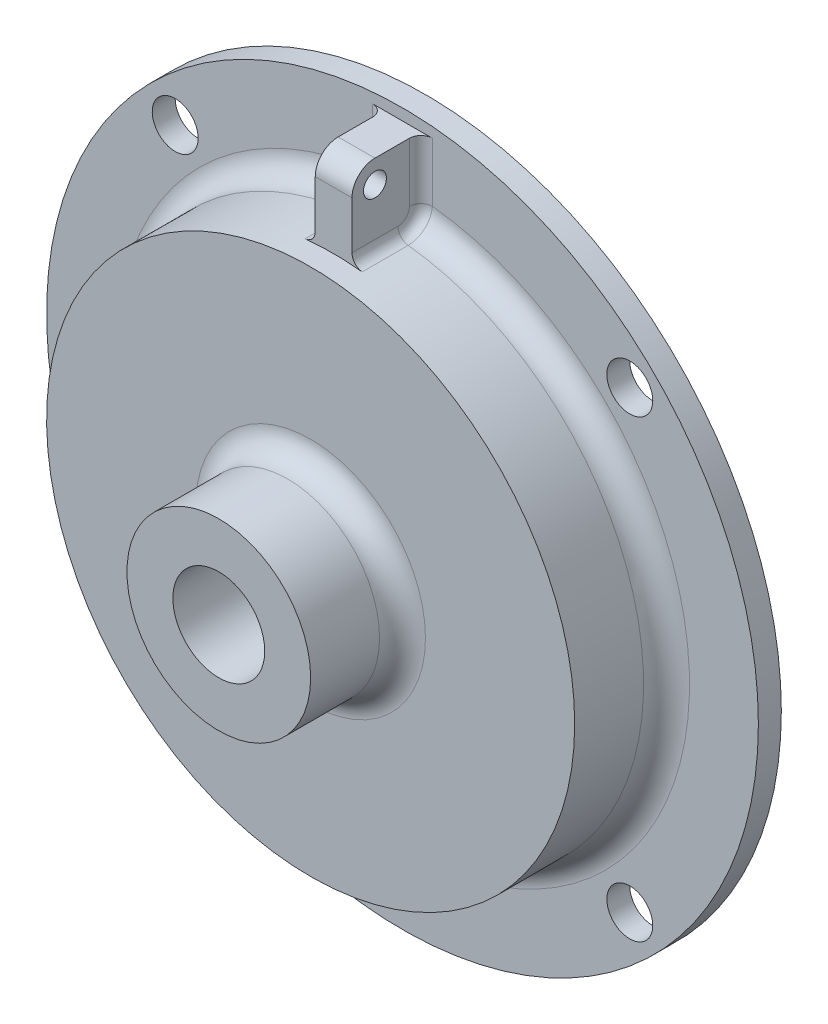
from build123d import *

# Parameters (mm, degrees)
SKETCH1_R           = 49.2125
BASE_EXTRUDE_DEPTH  = 3.175
SKETCH5_R           = 3.175
CUT_EXTRUDE2_DEPTH  = 70.669368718
CIRPATTERN1_COUNT   = 4
SKETCH2_R           = 36.5125
BOSS_EXTRUDE1_DEPTH = 12.7
SKETCH3_R           = 12.7
BOSS_EXTRUDE2_DEPTH = 12.7
FILLET1_R           = 3.175
SKETCH6_W           = 5.08
SKETCH6_H           = 9.525
BOSS_EXTRUDE3_DEPTH = 47.625
SKETCH4_R           = 6.35
CUT_EXTRUDE1_DEPTH  = 76.23477213
FILLET2_R           = 3.175
CUT_EXTRUDE3_REACH  = 78.92
SKETCH7_R           = 1.5875
FILLET3_R           = 1.5875


with BuildPart() as part:
    # Sketch1 → Base-Extrude (new body)
    with BuildSketch(Plane.XY):
        Circle(SKETCH1_R)
    extrude(amount=BASE_EXTRUDE_DEPTH)

    # Sketch5 → Cut-Extrude2 (cut, through all)
    with BuildSketch(Plane.XY.offset(3.175)):
        with Locations((31.430896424, 31.430896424)):
            Circle(SKETCH5_R)
    cut_extrude2 = extrude(amount=-CUT_EXTRUDE2_DEPTH, mode=Mode.SUBTRACT)

    # CirPattern1: Cut-Extrude2 ×4 about axis
    cirpattern1_axis = Axis((0, 0, 0), (0, 0, 1))
    for i in range(1, CIRPATTERN1_COUNT):
        add(cut_extrude2.rotate(cirpattern1_axis, i * 360 / CIRPATTERN1_COUNT), mode=Mode.SUBTRACT)

    # Sketch2 → Boss-Extrude1 (add)
    with BuildSketch(Plane.XY.offset(3.175)):
        Circle(SKETCH2_R)
    extrude(amount=BOSS_EXTRUDE1_DEPTH)

    # Sketch3 → Boss-Extrude2 (add)
    with BuildSketch(Plane.XY.offset(15.875)):
        Circle(SKETCH3_R)
    extrude(amount=BOSS_EXTRUDE2_DEPTH)

    # Fillet1
    fillet1_edges = [part.edges().sort_by_distance(p)[0] for p in [
        (-36.5125, 0, 3.175),
        (-12.7, 0, 15.875),
    ]]
    fillet(fillet1_edges, radius=FILLET1_R)

    # Sketch6 → Boss-Extrude3 (add)
    with BuildSketch(Plane(origin=(0, 0, 0), x_dir=(1, 0, 0), z_dir=(0, 1, 0))):
        with Locations((0, -7.9375)):
            Rectangle(SKETCH6_W, SKETCH6_H)
    extrude(amount=BOSS_EXTRUDE3_DEPTH)

    # Sketch4 → Cut-Extrude1 (cut, through all)
    with BuildSketch(Plane.XY.offset(28.575)):
        Circle(SKETCH4_R)
    extrude(amount=-CUT_EXTRUDE1_DEPTH, mode=Mode.SUBTRACT)

    # Fillet2
    fillet2_edges = [part.edges().sort_by_distance(p)[0] for p in [
        (0, 47.625, 12.7),
    ]]
    fillet(fillet2_edges, radius=FILLET2_R)

    # Sketch7 → Cut-Extrude3 (cut, up to next)
    with BuildSketch(Plane(origin=(2.54, 0, 0), x_dir=(0, 0, -1), z_dir=(1, 0, 0)), mode=Mode.PRIVATE) as cut_extrude3_sk1:
        with Locations((-9.525, 44.45)):
            Circle(SKETCH7_R)
    cut_extrude3_tool1 = extrude(cut_extrude3_sk1.sketch, amount=-CUT_EXTRUDE3_REACH, mode=Mode.PRIVATE) & part.part
    add(cut_extrude3_tool1.solids().sort_by_distance((2.54, 44.45, 9.525))[0], mode=Mode.SUBTRACT)

    # Fillet3
    fillet3_edges = [part.edges().sort_by_distance(p)[0] for p in [
        (2.54, 43.615568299, 3.175),
        (-2.54, 36.424045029, 9.5249997),
        (-2.54, 43.615568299, 3.175),
        (2.54, 36.424045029, 9.5249997),
    ]]
    fillet(fillet3_edges, radius=FILLET3_R)


solid = part.part
